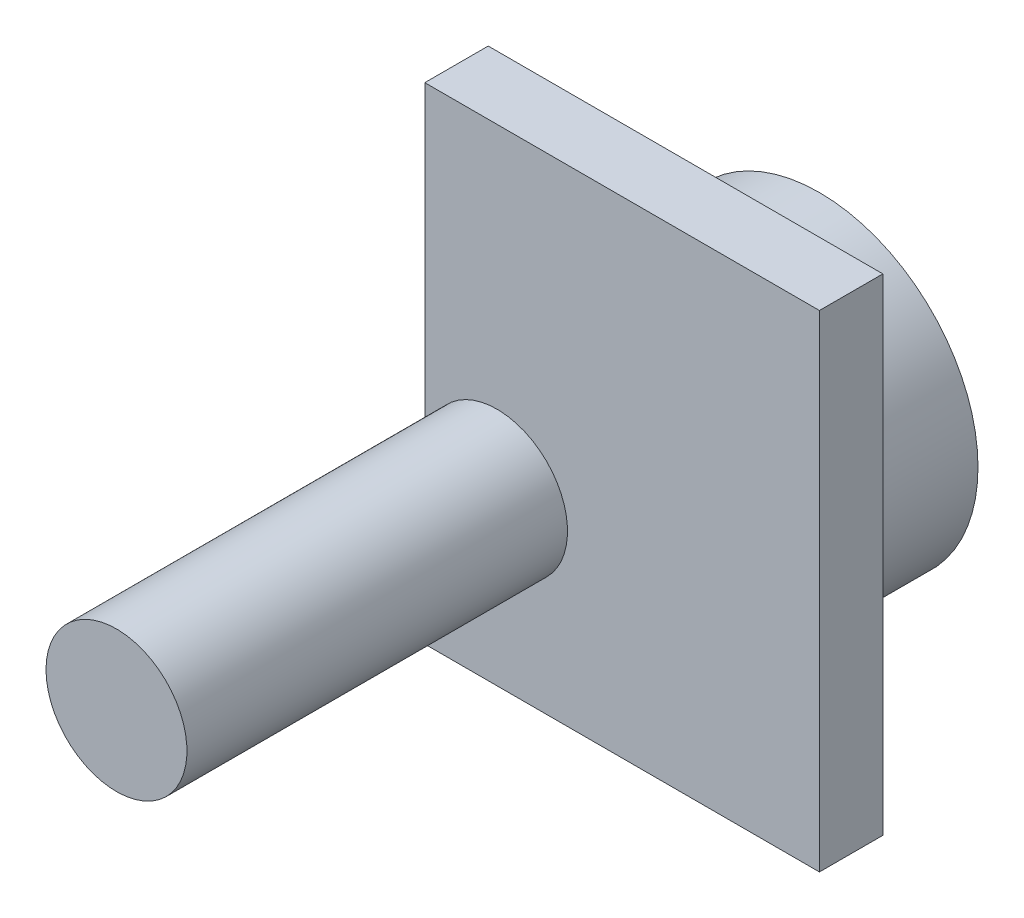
ISO-10303-21;
HEADER;
FILE_DESCRIPTION(('STEP AP214'),'2;1');
FILE_NAME('part.step','',(''),(''),'','','');
FILE_SCHEMA(('AUTOMOTIVE_DESIGN { 1 0 10303 214 1 1 1 1 }'));
ENDSEC;
DATA;
#1=APPLICATION_CONTEXT('core data for automotive mechanical design processes');
#2=APPLICATION_PROTOCOL_DEFINITION('international standard','automotive_design',2000,#1);
#3=PRODUCT_CONTEXT('',#1,'mechanical');
#4=PRODUCT('Part','Part','',(#3));
#5=PRODUCT_RELATED_PRODUCT_CATEGORY('part','',(#4));
#6=PRODUCT_DEFINITION_FORMATION('','',#4);
#7=PRODUCT_DEFINITION_CONTEXT('part definition',#1,'design');
#8=PRODUCT_DEFINITION('design','',#6,#7);
#9=PRODUCT_DEFINITION_SHAPE('','',#8);
#10=(LENGTH_UNIT() NAMED_UNIT(*) SI_UNIT(.MILLI.,.METRE.));
#11=(NAMED_UNIT(*) PLANE_ANGLE_UNIT() SI_UNIT($,.RADIAN.));
#12=(NAMED_UNIT(*) SI_UNIT($,.STERADIAN.) SOLID_ANGLE_UNIT());
#13=UNCERTAINTY_MEASURE_WITH_UNIT(LENGTH_MEASURE(1.E-05),#10,'distance_accuracy_value','');
#14=(GEOMETRIC_REPRESENTATION_CONTEXT(3) GLOBAL_UNCERTAINTY_ASSIGNED_CONTEXT((#13)) GLOBAL_UNIT_ASSIGNED_CONTEXT((#10,
#11,#12)) REPRESENTATION_CONTEXT('',''));
#15=CARTESIAN_POINT('',(0.,0.,0.));
#16=DIRECTION('',(0.,0.,1.));
#17=DIRECTION('',(1.,0.,0.));
#18=AXIS2_PLACEMENT_3D('',#15,#16,#17);
#19=CARTESIAN_POINT('',(-3.,-1.73,0.));
#20=DIRECTION('',(0.866025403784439,-0.5,0.));
#21=DIRECTION('',(0.5,0.866025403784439,0.));
#22=AXIS2_PLACEMENT_3D('',#19,#20,#21);
#23=PLANE('',#22);
#24=DIRECTION('',(0.5,0.866025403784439,0.));
#25=VECTOR('',#24,1.);
#26=CARTESIAN_POINT('',(-3.,-1.73,1.));
#27=LINE('',#26,#25);
#28=CARTESIAN_POINT('',(-3.,-1.73,1.));
#29=VERTEX_POINT('',#28);
#30=CARTESIAN_POINT('',(0.,3.46615242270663,1.));
#31=VERTEX_POINT('',#30);
#32=EDGE_CURVE('E100',#29,#31,#27,.T.);
#33=ORIENTED_EDGE('',*,*,#32,.T.);
#34=DIRECTION('',(0.,0.,1.));
#35=VECTOR('',#34,1.);
#36=CARTESIAN_POINT('',(0.,3.46615242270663,0.));
#37=LINE('',#36,#35);
#38=CARTESIAN_POINT('',(0.,3.46615242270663,0.));
#39=VERTEX_POINT('',#38);
#40=EDGE_CURVE('E12',#39,#31,#37,.T.);
#41=ORIENTED_EDGE('',*,*,#40,.F.);
#42=DIRECTION('',(0.5,0.866025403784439,0.));
#43=VECTOR('',#42,1.);
#44=CARTESIAN_POINT('',(-3.,-1.73,0.));
#45=LINE('',#44,#43);
#46=CARTESIAN_POINT('',(-3.,-1.73,0.));
#47=VERTEX_POINT('',#46);
#48=EDGE_CURVE('E93',#47,#39,#45,.T.);
#49=ORIENTED_EDGE('',*,*,#48,.F.);
#50=DIRECTION('',(0.,0.,1.));
#51=VECTOR('',#50,1.);
#52=CARTESIAN_POINT('',(-3.,-1.73,0.));
#53=LINE('',#52,#51);
#54=EDGE_CURVE('E101',#47,#29,#53,.T.);
#55=ORIENTED_EDGE('',*,*,#54,.T.);
#56=EDGE_LOOP('',(#33,#41,#49,#55));
#57=FACE_BOUND('',#56,.T.);
#58=ADVANCED_FACE('F53',(#57),#23,.F.);
#59=CARTESIAN_POINT('',(0.,3.46615242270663,0.));
#60=DIRECTION('',(-0.866025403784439,-0.5,0.));
#61=DIRECTION('',(0.5,-0.866025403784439,0.));
#62=AXIS2_PLACEMENT_3D('',#59,#60,#61);
#63=PLANE('',#62);
#64=DIRECTION('',(0.5,-0.866025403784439,0.));
#65=VECTOR('',#64,1.);
#66=CARTESIAN_POINT('',(0.,3.46615242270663,1.));
#67=LINE('',#66,#65);
#68=CARTESIAN_POINT('',(3.,-1.73,1.));
#69=VERTEX_POINT('',#68);
#70=EDGE_CURVE('E81',#31,#69,#67,.T.);
#71=ORIENTED_EDGE('',*,*,#70,.T.);
#72=DIRECTION('',(0.,0.,1.));
#73=VECTOR('',#72,1.);
#74=CARTESIAN_POINT('',(3.,-1.73,0.));
#75=LINE('',#74,#73);
#76=CARTESIAN_POINT('',(3.,-1.73,0.));
#77=VERTEX_POINT('',#76);
#78=EDGE_CURVE('E61',#77,#69,#75,.T.);
#79=ORIENTED_EDGE('',*,*,#78,.F.);
#80=DIRECTION('',(0.5,-0.866025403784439,0.));
#81=VECTOR('',#80,1.);
#82=CARTESIAN_POINT('',(0.,3.46615242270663,0.));
#83=LINE('',#82,#81);
#84=EDGE_CURVE('E89',#39,#77,#83,.T.);
#85=ORIENTED_EDGE('',*,*,#84,.F.);
#86=ORIENTED_EDGE('',*,*,#40,.T.);
#87=EDGE_LOOP('',(#71,#79,#85,#86));
#88=FACE_BOUND('',#87,.T.);
#89=ADVANCED_FACE('F90',(#88),#63,.F.);
#90=CARTESIAN_POINT('',(3.,-1.73,0.));
#91=DIRECTION('',(0.,1.,0.));
#92=DIRECTION('',(0.,0.,1.));
#93=AXIS2_PLACEMENT_3D('',#90,#91,#92);
#94=PLANE('',#93);
#95=DIRECTION('',(-1.,0.,0.));
#96=VECTOR('',#95,1.);
#97=CARTESIAN_POINT('',(3.,-1.73,1.));
#98=LINE('',#97,#96);
#99=EDGE_CURVE('E86',#69,#29,#98,.T.);
#100=ORIENTED_EDGE('',*,*,#99,.T.);
#101=ORIENTED_EDGE('',*,*,#54,.F.);
#102=DIRECTION('',(-1.,0.,0.));
#103=VECTOR('',#102,1.);
#104=CARTESIAN_POINT('',(3.,-1.73,0.));
#105=LINE('',#104,#103);
#106=EDGE_CURVE('E69',#77,#47,#105,.T.);
#107=ORIENTED_EDGE('',*,*,#106,.F.);
#108=ORIENTED_EDGE('',*,*,#78,.T.);
#109=EDGE_LOOP('',(#100,#101,#107,#108));
#110=FACE_BOUND('',#109,.T.);
#111=ADVANCED_FACE('F108',(#110),#94,.F.);
#112=CARTESIAN_POINT('',(0.,0.,0.));
#113=DIRECTION('',(0.,0.,-1.));
#114=DIRECTION('',(-1.,0.,0.));
#115=AXIS2_PLACEMENT_3D('',#112,#113,#114);
#116=PLANE('',#115);
#117=ORIENTED_EDGE('',*,*,#48,.T.);
#118=ORIENTED_EDGE('',*,*,#84,.T.);
#119=ORIENTED_EDGE('',*,*,#106,.T.);
#120=EDGE_LOOP('',(#117,#118,#119));
#121=FACE_BOUND('',#120,.T.);
#122=ADVANCED_FACE('F96',(#121),#116,.T.);
#123=CARTESIAN_POINT('',(0.,0.,1.));
#124=DIRECTION('',(0.,0.,-1.));
#125=DIRECTION('',(-1.,0.,0.));
#126=AXIS2_PLACEMENT_3D('',#123,#124,#125);
#127=PLANE('',#126);
#128=ORIENTED_EDGE('',*,*,#32,.F.);
#129=ORIENTED_EDGE('',*,*,#99,.F.);
#130=ORIENTED_EDGE('',*,*,#70,.F.);
#131=EDGE_LOOP('',(#128,#129,#130));
#132=FACE_BOUND('',#131,.T.);
#133=ADVANCED_FACE('F109',(#132),#127,.F.);
#134=CLOSED_SHELL('',(#58,#89,#111,#122,#133));
#135=MANIFOLD_SOLID_BREP('B2',#134);
#136=CARTESIAN_POINT('',(0.,0.,4.));
#137=DIRECTION('',(0.,0.,-1.));
#138=DIRECTION('',(-1.,0.,0.));
#139=AXIS2_PLACEMENT_3D('',#136,#137,#138);
#140=CYLINDRICAL_SURFACE('',#139,4.5);
#141=CARTESIAN_POINT('',(0.,0.,4.));
#142=DIRECTION('',(0.,0.,1.));
#143=DIRECTION('',(1.,0.,0.));
#144=AXIS2_PLACEMENT_3D('',#141,#142,#143);
#145=CIRCLE('',#144,4.5);
#146=CARTESIAN_POINT('',(4.5,0.,4.));
#147=VERTEX_POINT('',#146);
#148=EDGE_CURVE('E51',#147,#147,#145,.T.);
#149=ORIENTED_EDGE('',*,*,#148,.F.);
#150=EDGE_LOOP('',(#149));
#151=FACE_BOUND('',#150,.T.);
#152=CARTESIAN_POINT('',(0.,0.,0.));
#153=DIRECTION('',(0.,0.,1.));
#154=DIRECTION('',(1.,0.,0.));
#155=AXIS2_PLACEMENT_3D('',#152,#153,#154);
#156=CIRCLE('',#155,4.5);
#157=CARTESIAN_POINT('',(4.5,0.,0.));
#158=VERTEX_POINT('',#157);
#159=EDGE_CURVE('E164',#158,#158,#156,.T.);
#160=ORIENTED_EDGE('',*,*,#159,.T.);
#161=EDGE_LOOP('',(#160));
#162=FACE_BOUND('',#161,.T.);
#163=ADVANCED_FACE('F161',(#151,#162),#140,.T.);
#164=CARTESIAN_POINT('',(0.,0.,0.));
#165=DIRECTION('',(0.,0.,1.));
#166=DIRECTION('',(1.,0.,0.));
#167=AXIS2_PLACEMENT_3D('',#164,#165,#166);
#168=PLANE('',#167);
#169=DIRECTION('',(-1.,0.,0.));
#170=VECTOR('',#169,1.);
#171=CARTESIAN_POINT('',(3.,-1.73,0.));
#172=LINE('',#171,#170);
#173=CARTESIAN_POINT('',(3.,-1.73,0.));
#174=VERTEX_POINT('',#173);
#175=CARTESIAN_POINT('',(-3.,-1.73,0.));
#176=VERTEX_POINT('',#175);
#177=EDGE_CURVE('E254',#174,#176,#172,.T.);
#178=ORIENTED_EDGE('',*,*,#177,.F.);
#179=DIRECTION('',(0.5,-0.866025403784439,0.));
#180=VECTOR('',#179,1.);
#181=CARTESIAN_POINT('',(0.,3.46615242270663,0.));
#182=LINE('',#181,#180);
#183=CARTESIAN_POINT('',(0.,3.46615242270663,0.));
#184=VERTEX_POINT('',#183);
#185=EDGE_CURVE('E176',#184,#174,#182,.T.);
#186=ORIENTED_EDGE('',*,*,#185,.F.);
#187=DIRECTION('',(0.5,0.866025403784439,0.));
#188=VECTOR('',#187,1.);
#189=CARTESIAN_POINT('',(-3.,-1.73,0.));
#190=LINE('',#189,#188);
#191=EDGE_CURVE('E250',#176,#184,#190,.T.);
#192=ORIENTED_EDGE('',*,*,#191,.F.);
#193=EDGE_LOOP('',(#178,#186,#192));
#194=FACE_BOUND('',#193,.T.);
#195=ORIENTED_EDGE('',*,*,#159,.F.);
#196=EDGE_LOOP('',(#195));
#197=FACE_BOUND('',#196,.T.);
#198=ADVANCED_FACE('F312',(#194,#197),#168,.F.);
#199=CARTESIAN_POINT('',(-5.4,7.4,5.8));
#200=DIRECTION('',(1.,0.,0.));
#201=DIRECTION('',(0.,1.,0.));
#202=AXIS2_PLACEMENT_3D('',#199,#200,#201);
#203=PLANE('',#202);
#204=DIRECTION('',(0.,-1.,0.));
#205=VECTOR('',#204,1.);
#206=CARTESIAN_POINT('',(-5.4,7.4,4.));
#207=LINE('',#206,#205);
#208=CARTESIAN_POINT('',(-5.4,7.4,4.));
#209=VERTEX_POINT('',#208);
#210=CARTESIAN_POINT('',(-5.4,-6.4,4.));
#211=VERTEX_POINT('',#210);
#212=EDGE_CURVE('E270',#209,#211,#207,.T.);
#213=ORIENTED_EDGE('',*,*,#212,.T.);
#214=DIRECTION('',(0.,0.,-1.));
#215=VECTOR('',#214,1.);
#216=CARTESIAN_POINT('',(-5.4,-6.4,5.8));
#217=LINE('',#216,#215);
#218=CARTESIAN_POINT('',(-5.4,-6.4,5.8));
#219=VERTEX_POINT('',#218);
#220=EDGE_CURVE('E304',#219,#211,#217,.T.);
#221=ORIENTED_EDGE('',*,*,#220,.F.);
#222=DIRECTION('',(0.,-1.,0.));
#223=VECTOR('',#222,1.);
#224=CARTESIAN_POINT('',(-5.4,7.4,5.8));
#225=LINE('',#224,#223);
#226=CARTESIAN_POINT('',(-5.4,7.4,5.8));
#227=VERTEX_POINT('',#226);
#228=EDGE_CURVE('E273',#227,#219,#225,.T.);
#229=ORIENTED_EDGE('',*,*,#228,.F.);
#230=DIRECTION('',(0.,0.,-1.));
#231=VECTOR('',#230,1.);
#232=CARTESIAN_POINT('',(-5.4,7.4,5.8));
#233=LINE('',#232,#231);
#234=EDGE_CURVE('E283',#227,#209,#233,.T.);
#235=ORIENTED_EDGE('',*,*,#234,.T.);
#236=EDGE_LOOP('',(#213,#221,#229,#235));
#237=FACE_BOUND('',#236,.T.);
#238=ADVANCED_FACE('F314',(#237),#203,.F.);
#239=CARTESIAN_POINT('',(-5.4,-6.4,5.8));
#240=DIRECTION('',(0.,1.,0.));
#241=DIRECTION('',(0.,0.,1.));
#242=AXIS2_PLACEMENT_3D('',#239,#240,#241);
#243=PLANE('',#242);
#244=DIRECTION('',(1.,0.,0.));
#245=VECTOR('',#244,1.);
#246=CARTESIAN_POINT('',(-5.4,-6.4,4.));
#247=LINE('',#246,#245);
#248=CARTESIAN_POINT('',(5.8,-6.4,4.));
#249=VERTEX_POINT('',#248);
#250=EDGE_CURVE('E287',#211,#249,#247,.T.);
#251=ORIENTED_EDGE('',*,*,#250,.T.);
#252=DIRECTION('',(0.,0.,-1.));
#253=VECTOR('',#252,1.);
#254=CARTESIAN_POINT('',(5.8,-6.4,5.8));
#255=LINE('',#254,#253);
#256=CARTESIAN_POINT('',(5.8,-6.4,5.8));
#257=VERTEX_POINT('',#256);
#258=EDGE_CURVE('E300',#257,#249,#255,.T.);
#259=ORIENTED_EDGE('',*,*,#258,.F.);
#260=DIRECTION('',(1.,0.,0.));
#261=VECTOR('',#260,1.);
#262=CARTESIAN_POINT('',(-5.4,-6.4,5.8));
#263=LINE('',#262,#261);
#264=EDGE_CURVE('E214',#219,#257,#263,.T.);
#265=ORIENTED_EDGE('',*,*,#264,.F.);
#266=ORIENTED_EDGE('',*,*,#220,.T.);
#267=EDGE_LOOP('',(#251,#259,#265,#266));
#268=FACE_BOUND('',#267,.T.);
#269=ADVANCED_FACE('F320',(#268),#243,.F.);
#270=CARTESIAN_POINT('',(5.8,7.4,5.8));
#271=DIRECTION('',(-1.,0.,0.));
#272=DIRECTION('',(0.,-1.,0.));
#273=AXIS2_PLACEMENT_3D('',#270,#271,#272);
#274=PLANE('',#273);
#275=DIRECTION('',(0.,1.,0.));
#276=VECTOR('',#275,1.);
#277=CARTESIAN_POINT('',(5.8,7.4,4.));
#278=LINE('',#277,#276);
#279=CARTESIAN_POINT('',(5.8,7.4,4.));
#280=VERTEX_POINT('',#279);
#281=EDGE_CURVE('E290',#249,#280,#278,.T.);
#282=ORIENTED_EDGE('',*,*,#281,.T.);
#283=DIRECTION('',(0.,0.,-1.));
#284=VECTOR('',#283,1.);
#285=CARTESIAN_POINT('',(5.8,7.4,5.8));
#286=LINE('',#285,#284);
#287=CARTESIAN_POINT('',(5.8,7.4,5.8));
#288=VERTEX_POINT('',#287);
#289=EDGE_CURVE('E297',#288,#280,#286,.T.);
#290=ORIENTED_EDGE('',*,*,#289,.F.);
#291=DIRECTION('',(0.,1.,0.));
#292=VECTOR('',#291,1.);
#293=CARTESIAN_POINT('',(5.8,7.4,5.8));
#294=LINE('',#293,#292);
#295=EDGE_CURVE('E278',#257,#288,#294,.T.);
#296=ORIENTED_EDGE('',*,*,#295,.F.);
#297=ORIENTED_EDGE('',*,*,#258,.T.);
#298=EDGE_LOOP('',(#282,#290,#296,#297));
#299=FACE_BOUND('',#298,.T.);
#300=ADVANCED_FACE('F327',(#299),#274,.F.);
#301=CARTESIAN_POINT('',(-5.4,7.4,5.8));
#302=DIRECTION('',(0.,-1.,0.));
#303=DIRECTION('',(0.,0.,-1.));
#304=AXIS2_PLACEMENT_3D('',#301,#302,#303);
#305=PLANE('',#304);
#306=DIRECTION('',(-1.,0.,0.));
#307=VECTOR('',#306,1.);
#308=CARTESIAN_POINT('',(-5.4,7.4,4.));
#309=LINE('',#308,#307);
#310=EDGE_CURVE('E206',#280,#209,#309,.T.);
#311=ORIENTED_EDGE('',*,*,#310,.T.);
#312=ORIENTED_EDGE('',*,*,#234,.F.);
#313=DIRECTION('',(-1.,0.,0.));
#314=VECTOR('',#313,1.);
#315=CARTESIAN_POINT('',(-5.4,7.4,5.8));
#316=LINE('',#315,#314);
#317=EDGE_CURVE('E185',#288,#227,#316,.T.);
#318=ORIENTED_EDGE('',*,*,#317,.F.);
#319=ORIENTED_EDGE('',*,*,#289,.T.);
#320=EDGE_LOOP('',(#311,#312,#318,#319));
#321=FACE_BOUND('',#320,.T.);
#322=ADVANCED_FACE('F330',(#321),#305,.F.);
#323=CARTESIAN_POINT('',(0.,0.,5.8));
#324=DIRECTION('',(0.,0.,1.));
#325=DIRECTION('',(1.,0.,0.));
#326=AXIS2_PLACEMENT_3D('',#323,#324,#325);
#327=PLANE('',#326);
#328=CARTESIAN_POINT('',(-3.35,-1.6,5.8));
#329=DIRECTION('',(0.,0.,1.));
#330=DIRECTION('',(1.,0.,0.));
#331=AXIS2_PLACEMENT_3D('',#328,#329,#330);
#332=CIRCLE('',#331,2.);
#333=CARTESIAN_POINT('',(-5.35,-1.6,5.8));
#334=VERTEX_POINT('',#333);
#335=EDGE_CURVE('E257',#334,#334,#332,.T.);
#336=ORIENTED_EDGE('',*,*,#335,.F.);
#337=EDGE_LOOP('',(#336));
#338=FACE_BOUND('',#337,.T.);
#339=ORIENTED_EDGE('',*,*,#228,.T.);
#340=ORIENTED_EDGE('',*,*,#264,.T.);
#341=ORIENTED_EDGE('',*,*,#295,.T.);
#342=ORIENTED_EDGE('',*,*,#317,.T.);
#343=EDGE_LOOP('',(#339,#340,#341,#342));
#344=FACE_BOUND('',#343,.T.);
#345=ADVANCED_FACE('F334',(#338,#344),#327,.T.);
#346=CARTESIAN_POINT('',(0.,0.,4.));
#347=DIRECTION('',(0.,0.,1.));
#348=DIRECTION('',(1.,0.,0.));
#349=AXIS2_PLACEMENT_3D('',#346,#347,#348);
#350=PLANE('',#349);
#351=ORIENTED_EDGE('',*,*,#148,.T.);
#352=EDGE_LOOP('',(#351));
#353=FACE_BOUND('',#352,.T.);
#354=ORIENTED_EDGE('',*,*,#212,.F.);
#355=ORIENTED_EDGE('',*,*,#310,.F.);
#356=ORIENTED_EDGE('',*,*,#281,.F.);
#357=ORIENTED_EDGE('',*,*,#250,.F.);
#358=EDGE_LOOP('',(#354,#355,#356,#357));
#359=FACE_BOUND('',#358,.T.);
#360=ADVANCED_FACE('F335',(#353,#359),#350,.F.);
#361=CARTESIAN_POINT('',(0.,3.46615242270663,1.));
#362=DIRECTION('',(0.866025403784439,0.5,0.));
#363=DIRECTION('',(-0.5,0.866025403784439,0.));
#364=AXIS2_PLACEMENT_3D('',#361,#362,#363);
#365=PLANE('',#364);
#366=ORIENTED_EDGE('',*,*,#185,.T.);
#367=DIRECTION('',(0.,0.,-1.));
#368=VECTOR('',#367,1.);
#369=CARTESIAN_POINT('',(3.,-1.73,1.));
#370=LINE('',#369,#368);
#371=CARTESIAN_POINT('',(3.,-1.73,1.));
#372=VERTEX_POINT('',#371);
#373=EDGE_CURVE('E228',#372,#174,#370,.T.);
#374=ORIENTED_EDGE('',*,*,#373,.F.);
#375=DIRECTION('',(0.5,-0.866025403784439,0.));
#376=VECTOR('',#375,1.);
#377=CARTESIAN_POINT('',(0.,3.46615242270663,1.));
#378=LINE('',#377,#376);
#379=CARTESIAN_POINT('',(0.,3.46615242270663,1.));
#380=VERTEX_POINT('',#379);
#381=EDGE_CURVE('E232',#380,#372,#378,.T.);
#382=ORIENTED_EDGE('',*,*,#381,.F.);
#383=DIRECTION('',(0.,0.,-1.));
#384=VECTOR('',#383,1.);
#385=CARTESIAN_POINT('',(0.,3.46615242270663,1.));
#386=LINE('',#385,#384);
#387=EDGE_CURVE('E267',#380,#184,#386,.T.);
#388=ORIENTED_EDGE('',*,*,#387,.T.);
#389=EDGE_LOOP('',(#366,#374,#382,#388));
#390=FACE_BOUND('',#389,.T.);
#391=ADVANCED_FACE('F230',(#390),#365,.F.);
#392=CARTESIAN_POINT('',(-3.,-1.73,1.));
#393=DIRECTION('',(-0.866025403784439,0.5,0.));
#394=DIRECTION('',(-0.5,-0.866025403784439,0.));
#395=AXIS2_PLACEMENT_3D('',#392,#393,#394);
#396=PLANE('',#395);
#397=ORIENTED_EDGE('',*,*,#191,.T.);
#398=ORIENTED_EDGE('',*,*,#387,.F.);
#399=DIRECTION('',(0.5,0.866025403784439,0.));
#400=VECTOR('',#399,1.);
#401=CARTESIAN_POINT('',(-3.,-1.73,1.));
#402=LINE('',#401,#400);
#403=CARTESIAN_POINT('',(-3.,-1.73,1.));
#404=VERTEX_POINT('',#403);
#405=EDGE_CURVE('E239',#404,#380,#402,.T.);
#406=ORIENTED_EDGE('',*,*,#405,.F.);
#407=DIRECTION('',(0.,0.,-1.));
#408=VECTOR('',#407,1.);
#409=CARTESIAN_POINT('',(-3.,-1.73,1.));
#410=LINE('',#409,#408);
#411=EDGE_CURVE('E238',#404,#176,#410,.T.);
#412=ORIENTED_EDGE('',*,*,#411,.T.);
#413=EDGE_LOOP('',(#397,#398,#406,#412));
#414=FACE_BOUND('',#413,.T.);
#415=ADVANCED_FACE('F344',(#414),#396,.F.);
#416=CARTESIAN_POINT('',(3.,-1.73,1.));
#417=DIRECTION('',(0.,-1.,0.));
#418=DIRECTION('',(0.,0.,-1.));
#419=AXIS2_PLACEMENT_3D('',#416,#417,#418);
#420=PLANE('',#419);
#421=ORIENTED_EDGE('',*,*,#177,.T.);
#422=ORIENTED_EDGE('',*,*,#411,.F.);
#423=DIRECTION('',(-1.,0.,0.));
#424=VECTOR('',#423,1.);
#425=CARTESIAN_POINT('',(3.,-1.73,1.));
#426=LINE('',#425,#424);
#427=EDGE_CURVE('E242',#372,#404,#426,.T.);
#428=ORIENTED_EDGE('',*,*,#427,.F.);
#429=ORIENTED_EDGE('',*,*,#373,.T.);
#430=EDGE_LOOP('',(#421,#422,#428,#429));
#431=FACE_BOUND('',#430,.T.);
#432=ADVANCED_FACE('F243',(#431),#420,.F.);
#433=CARTESIAN_POINT('',(0.,0.,1.));
#434=DIRECTION('',(0.,0.,-1.));
#435=DIRECTION('',(-1.,0.,0.));
#436=AXIS2_PLACEMENT_3D('',#433,#434,#435);
#437=PLANE('',#436);
#438=ORIENTED_EDGE('',*,*,#381,.T.);
#439=ORIENTED_EDGE('',*,*,#427,.T.);
#440=ORIENTED_EDGE('',*,*,#405,.T.);
#441=EDGE_LOOP('',(#438,#439,#440));
#442=FACE_BOUND('',#441,.T.);
#443=ADVANCED_FACE('F248',(#442),#437,.T.);
#444=CARTESIAN_POINT('',(-3.35,-1.6,16.6));
#445=DIRECTION('',(0.,0.,-1.));
#446=DIRECTION('',(-1.,0.,0.));
#447=AXIS2_PLACEMENT_3D('',#444,#445,#446);
#448=CYLINDRICAL_SURFACE('',#447,2.);
#449=CARTESIAN_POINT('',(-3.35,-1.6,16.6));
#450=DIRECTION('',(0.,0.,1.));
#451=DIRECTION('',(1.,0.,0.));
#452=AXIS2_PLACEMENT_3D('',#449,#450,#451);
#453=CIRCLE('',#452,2.);
#454=CARTESIAN_POINT('',(-5.35,-1.6,16.6));
#455=VERTEX_POINT('',#454);
#456=EDGE_CURVE('E264',#455,#455,#453,.T.);
#457=CARTESIAN_POINT('',(-5.35,-1.6,16.6));
#458=CARTESIAN_POINT('',(-5.35,-1.6,16.4875));
#459=CARTESIAN_POINT('',(-5.35,-1.6,16.375));
#460=CARTESIAN_POINT('',(-5.35,-1.6,16.15));
#461=CARTESIAN_POINT('',(-5.35,-1.6,16.0375));
#462=CARTESIAN_POINT('',(-5.35,-1.6,15.8125));
#463=CARTESIAN_POINT('',(-5.35,-1.6,15.7));
#464=CARTESIAN_POINT('',(-5.35,-1.6,15.475));
#465=CARTESIAN_POINT('',(-5.35,-1.6,15.3625));
#466=CARTESIAN_POINT('',(-5.35,-1.6,15.1375));
#467=CARTESIAN_POINT('',(-5.35,-1.6,15.025));
#468=CARTESIAN_POINT('',(-5.35,-1.6,14.8));
#469=CARTESIAN_POINT('',(-5.35,-1.6,14.6875));
#470=CARTESIAN_POINT('',(-5.35,-1.6,14.4625));
#471=CARTESIAN_POINT('',(-5.35,-1.6,14.35));
#472=CARTESIAN_POINT('',(-5.35,-1.6,14.125));
#473=CARTESIAN_POINT('',(-5.35,-1.6,14.0125));
#474=CARTESIAN_POINT('',(-5.35,-1.6,13.7875));
#475=CARTESIAN_POINT('',(-5.35,-1.6,13.675));
#476=CARTESIAN_POINT('',(-5.35,-1.6,13.45));
#477=CARTESIAN_POINT('',(-5.35,-1.6,13.3375));
#478=CARTESIAN_POINT('',(-5.35,-1.6,13.1125));
#479=CARTESIAN_POINT('',(-5.35,-1.6,13.));
#480=CARTESIAN_POINT('',(-5.35,-1.6,12.775));
#481=CARTESIAN_POINT('',(-5.35,-1.6,12.6625));
#482=CARTESIAN_POINT('',(-5.35,-1.6,12.4375));
#483=CARTESIAN_POINT('',(-5.35,-1.6,12.325));
#484=CARTESIAN_POINT('',(-5.35,-1.6,12.1));
#485=CARTESIAN_POINT('',(-5.35,-1.6,11.9875));
#486=CARTESIAN_POINT('',(-5.35,-1.6,11.7625));
#487=CARTESIAN_POINT('',(-5.35,-1.6,11.65));
#488=CARTESIAN_POINT('',(-5.35,-1.6,11.425));
#489=CARTESIAN_POINT('',(-5.35,-1.6,11.3125));
#490=CARTESIAN_POINT('',(-5.35,-1.6,11.0875));
#491=CARTESIAN_POINT('',(-5.35,-1.6,10.975));
#492=CARTESIAN_POINT('',(-5.35,-1.6,10.75));
#493=CARTESIAN_POINT('',(-5.35,-1.6,10.6375));
#494=CARTESIAN_POINT('',(-5.35,-1.6,10.4125));
#495=CARTESIAN_POINT('',(-5.35,-1.6,10.3));
#496=CARTESIAN_POINT('',(-5.35,-1.6,10.075));
#497=CARTESIAN_POINT('',(-5.35,-1.6,9.9625));
#498=CARTESIAN_POINT('',(-5.35,-1.6,9.7375));
#499=CARTESIAN_POINT('',(-5.35,-1.6,9.625));
#500=CARTESIAN_POINT('',(-5.35,-1.6,9.4));
#501=CARTESIAN_POINT('',(-5.35,-1.6,9.2875));
#502=CARTESIAN_POINT('',(-5.35,-1.6,9.0625));
#503=CARTESIAN_POINT('',(-5.35,-1.6,8.95));
#504=CARTESIAN_POINT('',(-5.35,-1.6,8.725));
#505=CARTESIAN_POINT('',(-5.35,-1.6,8.6125));
#506=CARTESIAN_POINT('',(-5.35,-1.6,8.3875));
#507=CARTESIAN_POINT('',(-5.35,-1.6,8.275));
#508=CARTESIAN_POINT('',(-5.35,-1.6,8.05));
#509=CARTESIAN_POINT('',(-5.35,-1.6,7.9375));
#510=CARTESIAN_POINT('',(-5.35,-1.6,7.7125));
#511=CARTESIAN_POINT('',(-5.35,-1.6,7.6));
#512=CARTESIAN_POINT('',(-5.35,-1.6,7.375));
#513=CARTESIAN_POINT('',(-5.35,-1.6,7.2625));
#514=CARTESIAN_POINT('',(-5.35,-1.6,7.0375));
#515=CARTESIAN_POINT('',(-5.35,-1.6,6.925));
#516=CARTESIAN_POINT('',(-5.35,-1.6,6.7));
#517=CARTESIAN_POINT('',(-5.35,-1.6,6.5875));
#518=CARTESIAN_POINT('',(-5.35,-1.6,6.3625));
#519=CARTESIAN_POINT('',(-5.35,-1.6,6.25));
#520=CARTESIAN_POINT('',(-5.35,-1.6,6.025));
#521=CARTESIAN_POINT('',(-5.35,-1.6,5.9125));
#522=CARTESIAN_POINT('',(-5.35,-1.6,5.8));
#523=B_SPLINE_CURVE_WITH_KNOTS('',3,(#457,#458,#459,#460,#461,#462,#463,#464,#465,#466,#467,
#468,#469,#470,#471,#472,#473,#474,#475,#476,#477,#478,#479,#480,#481,#482,#483,#484,#485,#486,
#487,#488,#489,#490,#491,#492,#493,#494,#495,#496,#497,#498,#499,#500,#501,#502,#503,#504,#505,
#506,#507,#508,#509,#510,#511,#512,#513,#514,#515,#516,#517,#518,#519,#520,#521,#522),
.UNSPECIFIED.,.F.,.F.,(4,2,2,2,2,2,2,2,2,2,2,2,2,2,2,2,2,2,2,2,2,2,2,2,2,2,2,2,2,2,2,2,4),(0.,
0.337500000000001,0.675000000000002,1.0125,1.35,1.6875,2.025,2.3625,2.7,3.0375,3.375,3.7125,
4.05,4.3875,4.725,5.0625,5.4,5.7375,6.075,6.4125,6.75,7.0875,7.425,7.7625,8.1,8.4375,8.775,
9.1125,9.45,9.7875,10.125,10.4625,10.8),.UNSPECIFIED.);
#524=EDGE_CURVE('BSEAM352',#455,#334,#523,.T.);
#525=ORIENTED_EDGE('',*,*,#456,.F.);
#526=ORIENTED_EDGE('',*,*,#335,.T.);
#527=ORIENTED_EDGE('',*,*,#524,.T.);
#528=ORIENTED_EDGE('',*,*,#524,.F.);
#529=EDGE_LOOP('',(#525,#527,#526,#528));
#530=FACE_BOUND('',#529,.T.);
#531=ADVANCED_FACE('F352',(#530),#448,.T.);
#532=CARTESIAN_POINT('',(-3.35,-1.6,16.6));
#533=DIRECTION('',(0.,0.,1.));
#534=DIRECTION('',(1.,0.,0.));
#535=AXIS2_PLACEMENT_3D('',#532,#533,#534);
#536=PLANE('',#535);
#537=ORIENTED_EDGE('',*,*,#456,.T.);
#538=EDGE_LOOP('',(#537));
#539=FACE_BOUND('',#538,.T.);
#540=ADVANCED_FACE('F355',(#539),#536,.T.);
#541=CLOSED_SHELL('',(#163,#198,#238,#269,#300,#322,#345,#360,#391,#415,#432,#443,#531,#540));
#542=MANIFOLD_SOLID_BREP('B6',#541);
#543=ADVANCED_BREP_SHAPE_REPRESENTATION('',(#18,#135,#542),#14);
#544=SHAPE_DEFINITION_REPRESENTATION(#9,#543);
ENDSEC;
END-ISO-10303-21;
